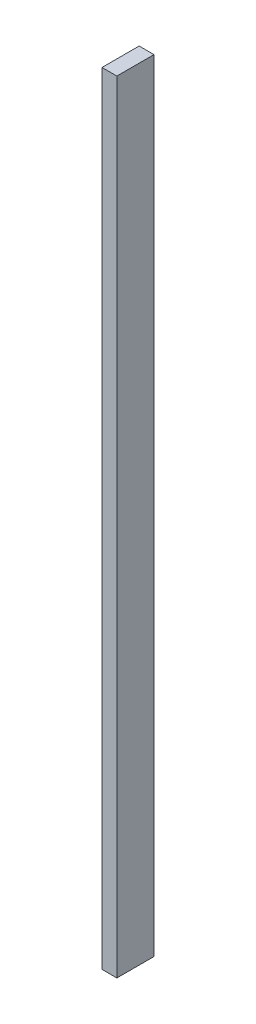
from build123d import *

# Parameters (mm, degrees)
ESQUISSE1_W      = 20
ESQUISSE1_H      = 50
EXTRUSION1_DEPTH = 1051


with BuildPart() as part:
    # Esquisse1 → Extrusion1 (new body)
    with BuildSketch(Plane(origin=(0, 0, 0), x_dir=(1, 0, 0), z_dir=(0, 1, 0))):
        with Locations((10, 25)):
            Rectangle(ESQUISSE1_W, ESQUISSE1_H)
    extrude(amount=EXTRUSION1_DEPTH)


solid = part.part
